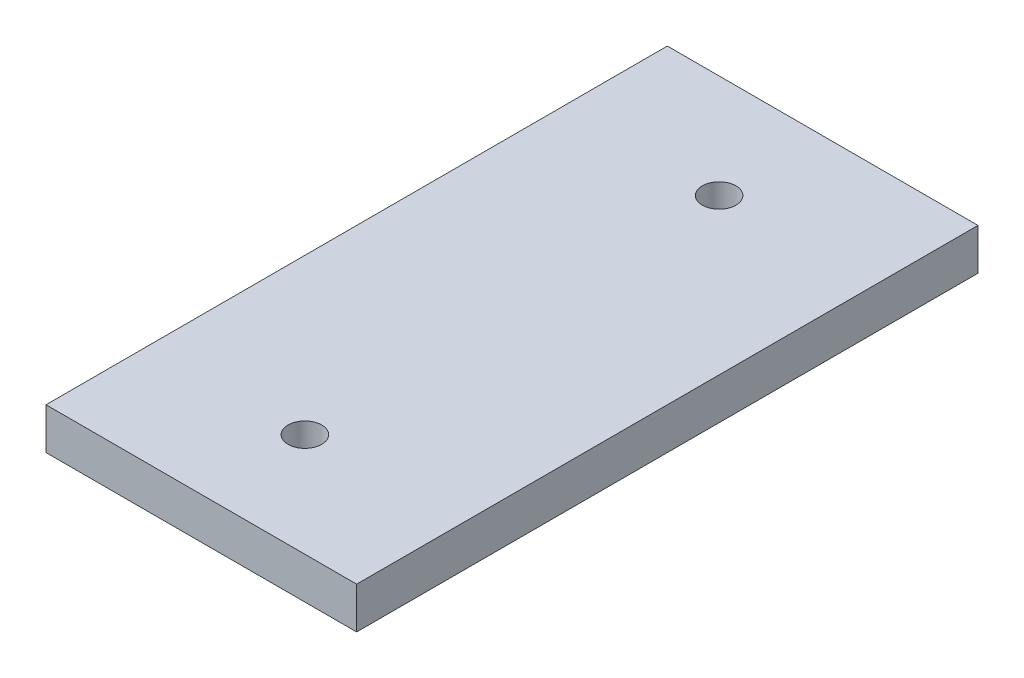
ISO-10303-21;
HEADER;
FILE_DESCRIPTION(('STEP AP214'),'2;1');
FILE_NAME('part.step','',(''),(''),'','','');
FILE_SCHEMA(('AUTOMOTIVE_DESIGN { 1 0 10303 214 1 1 1 1 }'));
ENDSEC;
DATA;
#1=APPLICATION_CONTEXT('core data for automotive mechanical design processes');
#2=APPLICATION_PROTOCOL_DEFINITION('international standard','automotive_design',2000,#1);
#3=PRODUCT_CONTEXT('',#1,'mechanical');
#4=PRODUCT('Part','Part','',(#3));
#5=PRODUCT_RELATED_PRODUCT_CATEGORY('part','',(#4));
#6=PRODUCT_DEFINITION_FORMATION('','',#4);
#7=PRODUCT_DEFINITION_CONTEXT('part definition',#1,'design');
#8=PRODUCT_DEFINITION('design','',#6,#7);
#9=PRODUCT_DEFINITION_SHAPE('','',#8);
#10=(LENGTH_UNIT() NAMED_UNIT(*) SI_UNIT(.MILLI.,.METRE.));
#11=(NAMED_UNIT(*) PLANE_ANGLE_UNIT() SI_UNIT($,.RADIAN.));
#12=(NAMED_UNIT(*) SI_UNIT($,.STERADIAN.) SOLID_ANGLE_UNIT());
#13=UNCERTAINTY_MEASURE_WITH_UNIT(LENGTH_MEASURE(1.E-05),#10,'distance_accuracy_value','');
#14=(GEOMETRIC_REPRESENTATION_CONTEXT(3) GLOBAL_UNCERTAINTY_ASSIGNED_CONTEXT((#13)) GLOBAL_UNIT_ASSIGNED_CONTEXT((#10,
#11,#12)) REPRESENTATION_CONTEXT('',''));
#15=CARTESIAN_POINT('',(0.,0.,0.));
#16=DIRECTION('',(0.,0.,1.));
#17=DIRECTION('',(1.,0.,0.));
#18=AXIS2_PLACEMENT_3D('',#15,#16,#17);
#19=CARTESIAN_POINT('',(0.,0.,120.));
#20=DIRECTION('',(1.,0.,0.));
#21=DIRECTION('',(0.,1.,0.));
#22=AXIS2_PLACEMENT_3D('',#19,#20,#21);
#23=PLANE('',#22);
#24=DIRECTION('',(0.,-1.,0.));
#25=VECTOR('',#24,1.);
#26=CARTESIAN_POINT('',(0.,0.,0.));
#27=LINE('',#26,#25);
#28=CARTESIAN_POINT('',(0.,0.,0.));
#29=VERTEX_POINT('',#28);
#30=CARTESIAN_POINT('',(0.,-8.,0.));
#31=VERTEX_POINT('',#30);
#32=EDGE_CURVE('E73',#29,#31,#27,.T.);
#33=ORIENTED_EDGE('',*,*,#32,.T.);
#34=DIRECTION('',(0.,0.,-1.));
#35=VECTOR('',#34,1.);
#36=CARTESIAN_POINT('',(0.,-8.,120.));
#37=LINE('',#36,#35);
#38=CARTESIAN_POINT('',(0.,-8.,120.));
#39=VERTEX_POINT('',#38);
#40=EDGE_CURVE('E11',#39,#31,#37,.T.);
#41=ORIENTED_EDGE('',*,*,#40,.F.);
#42=DIRECTION('',(0.,-1.,0.));
#43=VECTOR('',#42,1.);
#44=CARTESIAN_POINT('',(0.,0.,120.));
#45=LINE('',#44,#43);
#46=CARTESIAN_POINT('',(0.,0.,120.));
#47=VERTEX_POINT('',#46);
#48=EDGE_CURVE('E96',#47,#39,#45,.T.);
#49=ORIENTED_EDGE('',*,*,#48,.F.);
#50=DIRECTION('',(0.,0.,-1.));
#51=VECTOR('',#50,1.);
#52=CARTESIAN_POINT('',(0.,0.,120.));
#53=LINE('',#52,#51);
#54=EDGE_CURVE('E85',#47,#29,#53,.T.);
#55=ORIENTED_EDGE('',*,*,#54,.T.);
#56=EDGE_LOOP('',(#33,#41,#49,#55));
#57=FACE_BOUND('',#56,.T.);
#58=ADVANCED_FACE('F29',(#57),#23,.F.);
#59=CARTESIAN_POINT('',(0.,-8.,120.));
#60=DIRECTION('',(0.,1.,0.));
#61=DIRECTION('',(0.,0.,1.));
#62=AXIS2_PLACEMENT_3D('',#59,#60,#61);
#63=PLANE('',#62);
#64=CARTESIAN_POINT('',(30.,-8.,20.));
#65=DIRECTION('',(0.,1.,0.));
#66=DIRECTION('',(0.,0.,1.));
#67=AXIS2_PLACEMENT_3D('',#64,#65,#66);
#68=CIRCLE('',#67,3.25);
#69=CARTESIAN_POINT('',(30.,-8.,23.25));
#70=VERTEX_POINT('',#69);
#71=EDGE_CURVE('E131',#70,#70,#68,.T.);
#72=ORIENTED_EDGE('',*,*,#71,.T.);
#73=EDGE_LOOP('',(#72));
#74=FACE_BOUND('',#73,.T.);
#75=CARTESIAN_POINT('',(30.,-8.,100.));
#76=DIRECTION('',(0.,1.,0.));
#77=DIRECTION('',(0.,0.,1.));
#78=AXIS2_PLACEMENT_3D('',#75,#76,#77);
#79=CIRCLE('',#78,3.25);
#80=CARTESIAN_POINT('',(30.,-8.,103.25));
#81=VERTEX_POINT('',#80);
#82=EDGE_CURVE('E86',#81,#81,#79,.T.);
#83=ORIENTED_EDGE('',*,*,#82,.T.);
#84=EDGE_LOOP('',(#83));
#85=FACE_BOUND('',#84,.T.);
#86=DIRECTION('',(1.,0.,0.));
#87=VECTOR('',#86,1.);
#88=CARTESIAN_POINT('',(0.,-8.,0.));
#89=LINE('',#88,#87);
#90=CARTESIAN_POINT('',(60.,-8.,0.));
#91=VERTEX_POINT('',#90);
#92=EDGE_CURVE('E69',#31,#91,#89,.T.);
#93=ORIENTED_EDGE('',*,*,#92,.T.);
#94=DIRECTION('',(0.,0.,-1.));
#95=VECTOR('',#94,1.);
#96=CARTESIAN_POINT('',(60.,-8.,120.));
#97=LINE('',#96,#95);
#98=CARTESIAN_POINT('',(60.,-8.,120.));
#99=VERTEX_POINT('',#98);
#100=EDGE_CURVE('E36',#99,#91,#97,.T.);
#101=ORIENTED_EDGE('',*,*,#100,.F.);
#102=DIRECTION('',(1.,0.,0.));
#103=VECTOR('',#102,1.);
#104=CARTESIAN_POINT('',(0.,-8.,120.));
#105=LINE('',#104,#103);
#106=EDGE_CURVE('E81',#39,#99,#105,.T.);
#107=ORIENTED_EDGE('',*,*,#106,.F.);
#108=ORIENTED_EDGE('',*,*,#40,.T.);
#109=EDGE_LOOP('',(#93,#101,#107,#108));
#110=FACE_BOUND('',#109,.T.);
#111=ADVANCED_FACE('F80',(#74,#85,#110),#63,.F.);
#112=CARTESIAN_POINT('',(60.,0.,120.));
#113=DIRECTION('',(-1.,0.,0.));
#114=DIRECTION('',(0.,0.,1.));
#115=AXIS2_PLACEMENT_3D('',#112,#113,#114);
#116=PLANE('',#115);
#117=DIRECTION('',(0.,1.,0.));
#118=VECTOR('',#117,1.);
#119=CARTESIAN_POINT('',(60.,0.,0.));
#120=LINE('',#119,#118);
#121=CARTESIAN_POINT('',(60.,0.,0.));
#122=VERTEX_POINT('',#121);
#123=EDGE_CURVE('E74',#91,#122,#120,.T.);
#124=ORIENTED_EDGE('',*,*,#123,.T.);
#125=DIRECTION('',(0.,0.,-1.));
#126=VECTOR('',#125,1.);
#127=CARTESIAN_POINT('',(60.,0.,120.));
#128=LINE('',#127,#126);
#129=CARTESIAN_POINT('',(60.,0.,120.));
#130=VERTEX_POINT('',#129);
#131=EDGE_CURVE('E102',#130,#122,#128,.T.);
#132=ORIENTED_EDGE('',*,*,#131,.F.);
#133=DIRECTION('',(0.,1.,0.));
#134=VECTOR('',#133,1.);
#135=CARTESIAN_POINT('',(60.,0.,120.));
#136=LINE('',#135,#134);
#137=EDGE_CURVE('E48',#99,#130,#136,.T.);
#138=ORIENTED_EDGE('',*,*,#137,.F.);
#139=ORIENTED_EDGE('',*,*,#100,.T.);
#140=EDGE_LOOP('',(#124,#132,#138,#139));
#141=FACE_BOUND('',#140,.T.);
#142=ADVANCED_FACE('F105',(#141),#116,.F.);
#143=CARTESIAN_POINT('',(0.,0.,120.));
#144=DIRECTION('',(0.,-1.,0.));
#145=DIRECTION('',(0.,0.,-1.));
#146=AXIS2_PLACEMENT_3D('',#143,#144,#145);
#147=PLANE('',#146);
#148=CARTESIAN_POINT('',(30.,0.,20.));
#149=DIRECTION('',(0.,1.,0.));
#150=DIRECTION('',(0.,0.,1.));
#151=AXIS2_PLACEMENT_3D('',#148,#149,#150);
#152=CIRCLE('',#151,3.25);
#153=CARTESIAN_POINT('',(30.,0.,23.25));
#154=VERTEX_POINT('',#153);
#155=EDGE_CURVE('E146',#154,#154,#152,.T.);
#156=ORIENTED_EDGE('',*,*,#155,.F.);
#157=EDGE_LOOP('',(#156));
#158=FACE_BOUND('',#157,.T.);
#159=CARTESIAN_POINT('',(30.,0.,100.));
#160=DIRECTION('',(0.,1.,0.));
#161=DIRECTION('',(0.,0.,1.));
#162=AXIS2_PLACEMENT_3D('',#159,#160,#161);
#163=CIRCLE('',#162,3.25);
#164=CARTESIAN_POINT('',(30.,0.,103.25));
#165=VERTEX_POINT('',#164);
#166=EDGE_CURVE('E89',#165,#165,#163,.T.);
#167=ORIENTED_EDGE('',*,*,#166,.F.);
#168=EDGE_LOOP('',(#167));
#169=FACE_BOUND('',#168,.T.);
#170=DIRECTION('',(-1.,0.,0.));
#171=VECTOR('',#170,1.);
#172=CARTESIAN_POINT('',(0.,0.,0.));
#173=LINE('',#172,#171);
#174=EDGE_CURVE('E94',#122,#29,#173,.T.);
#175=ORIENTED_EDGE('',*,*,#174,.T.);
#176=ORIENTED_EDGE('',*,*,#54,.F.);
#177=DIRECTION('',(-1.,0.,0.));
#178=VECTOR('',#177,1.);
#179=CARTESIAN_POINT('',(0.,0.,120.));
#180=LINE('',#179,#178);
#181=EDGE_CURVE('E43',#130,#47,#180,.T.);
#182=ORIENTED_EDGE('',*,*,#181,.F.);
#183=ORIENTED_EDGE('',*,*,#131,.T.);
#184=EDGE_LOOP('',(#175,#176,#182,#183));
#185=FACE_BOUND('',#184,.T.);
#186=ADVANCED_FACE('F107',(#158,#169,#185),#147,.F.);
#187=CARTESIAN_POINT('',(0.,-8.,120.));
#188=DIRECTION('',(0.,0.,1.));
#189=DIRECTION('',(1.,0.,0.));
#190=AXIS2_PLACEMENT_3D('',#187,#188,#189);
#191=PLANE('',#190);
#192=ORIENTED_EDGE('',*,*,#48,.T.);
#193=ORIENTED_EDGE('',*,*,#106,.T.);
#194=ORIENTED_EDGE('',*,*,#137,.T.);
#195=ORIENTED_EDGE('',*,*,#181,.T.);
#196=EDGE_LOOP('',(#192,#193,#194,#195));
#197=FACE_BOUND('',#196,.T.);
#198=ADVANCED_FACE('F108',(#197),#191,.T.);
#199=CARTESIAN_POINT('',(0.,-8.,0.));
#200=DIRECTION('',(0.,0.,1.));
#201=DIRECTION('',(1.,0.,0.));
#202=AXIS2_PLACEMENT_3D('',#199,#200,#201);
#203=PLANE('',#202);
#204=ORIENTED_EDGE('',*,*,#32,.F.);
#205=ORIENTED_EDGE('',*,*,#174,.F.);
#206=ORIENTED_EDGE('',*,*,#123,.F.);
#207=ORIENTED_EDGE('',*,*,#92,.F.);
#208=EDGE_LOOP('',(#204,#205,#206,#207));
#209=FACE_BOUND('',#208,.T.);
#210=ADVANCED_FACE('F70',(#209),#203,.F.);
#211=CARTESIAN_POINT('',(30.,-10.,100.));
#212=DIRECTION('',(0.,1.,0.));
#213=DIRECTION('',(0.,0.,1.));
#214=AXIS2_PLACEMENT_3D('',#211,#212,#213);
#215=CYLINDRICAL_SURFACE('',#214,3.25);
#216=ORIENTED_EDGE('',*,*,#166,.T.);
#217=EDGE_LOOP('',(#216));
#218=FACE_BOUND('',#217,.T.);
#219=ORIENTED_EDGE('',*,*,#82,.F.);
#220=EDGE_LOOP('',(#219));
#221=FACE_BOUND('',#220,.T.);
#222=ADVANCED_FACE('F115',(#218,#221),#215,.F.);
#223=CARTESIAN_POINT('',(30.,-10.,20.));
#224=DIRECTION('',(0.,1.,0.));
#225=DIRECTION('',(0.,0.,1.));
#226=AXIS2_PLACEMENT_3D('',#223,#224,#225);
#227=CYLINDRICAL_SURFACE('',#226,3.25);
#228=ORIENTED_EDGE('',*,*,#155,.T.);
#229=EDGE_LOOP('',(#228));
#230=FACE_BOUND('',#229,.T.);
#231=ORIENTED_EDGE('',*,*,#71,.F.);
#232=EDGE_LOOP('',(#231));
#233=FACE_BOUND('',#232,.T.);
#234=ADVANCED_FACE('F135',(#230,#233),#227,.F.);
#235=CLOSED_SHELL('',(#58,#111,#142,#186,#198,#210,#222,#234));
#236=MANIFOLD_SOLID_BREP('B2',#235);
#237=ADVANCED_BREP_SHAPE_REPRESENTATION('',(#18,#236),#14);
#238=SHAPE_DEFINITION_REPRESENTATION(#9,#237);
ENDSEC;
END-ISO-10303-21;
